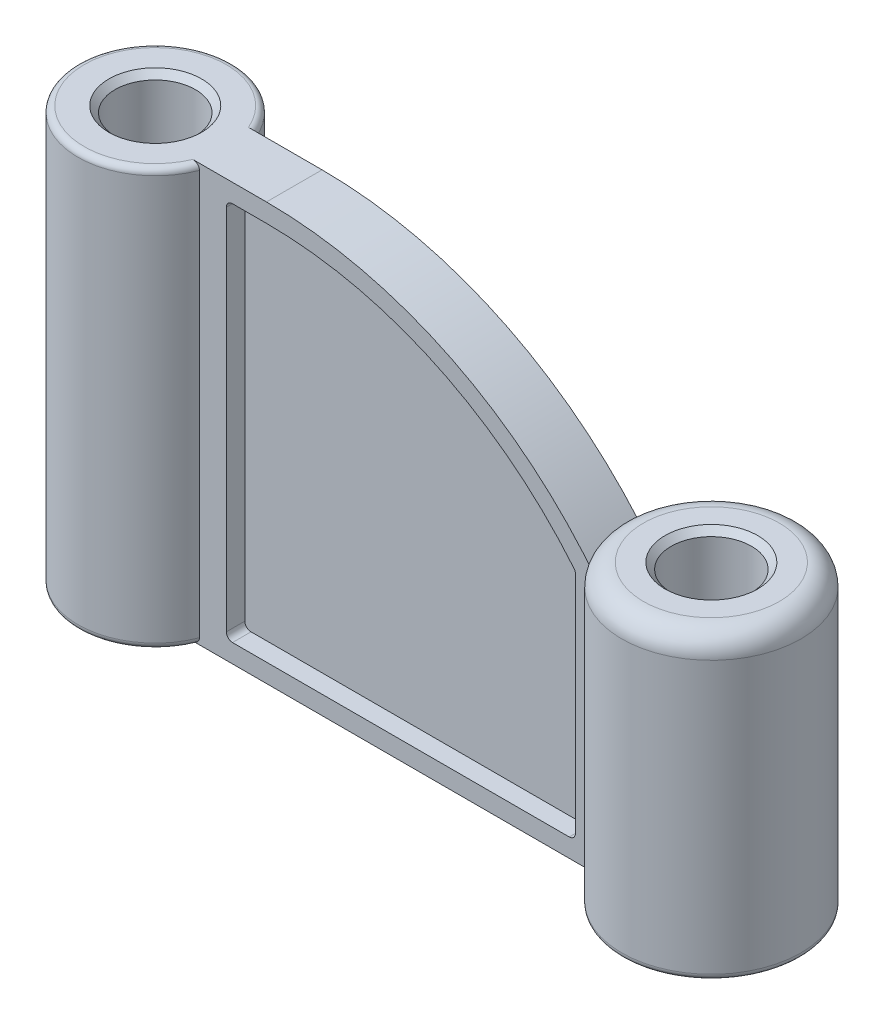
from build123d import *

# Parameters (mm, degrees)
SKETCH1_R               = 13
BOSS_EXTRUDE1_DEPTH     = 135
CUT_EXTRUDE2_DEPTH      = 252.694258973
CUT_EXTRUDE3_DEPTH      = 251.49351289
CUT_EXTRUDE3_DEPTH_BACK = 251.49351289
SKETCH3_W               = 56.568097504
SKETCH3_H               = 100
BOSS_EXTRUDE2_REACH     = 234.23
SKETCH4_R               = 29
SKETCH4_R_2             = 13
CUT_EXTRUDE4_DEPTH      = 6
CHAMFER1_SIZE           = 2
FILLET1_R               = 7
FILLET2_R               = 2


with BuildPart() as part:
    # Sketch1 → Boss-Extrude1 (new body)
    with BuildSketch(Plane(origin=(0, 0, 0), x_dir=(1, 0, 0), z_dir=(0, 1, 0))):
        with BuildLine():
            Line((23.323807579, -9), (152.431902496, -9))
            ThreePointArc((152.431902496, -9), (209, 0), (152.431902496, 9))
            Line((152.431902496, 9), (23.323807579, 9))
            ThreePointArc((23.323807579, 9), (-25, 0), (23.323807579, -9))
        make_face()
        with Locations(Location((0, 0, 0), (0, 0, 270))):
            Circle(SKETCH1_R, mode=Mode.SUBTRACT)
        with Locations(Location((180, 0, 0), (0, 0, 270))):
            Circle(SKETCH1_R, mode=Mode.SUBTRACT)
    extrude(amount=BOSS_EXTRUDE1_DEPTH)

    # Sketch2 → Cut-Extrude2 (cut, through all)
    with BuildSketch(Plane.XY.offset(9)):
        with BuildLine():
            Line((23.323807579, 135), (45, 135))
            ThreePointArc((45, 135), (104.951991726, 120.957673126), (152.431902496, 81.751980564))
            Line((152.431902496, 81.751980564), (152.431902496, 171.443845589))
            Line((152.431902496, 171.443845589), (23.323807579, 171.443845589))
            Line((23.323807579, 171.443845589), (23.323807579, 135))
        make_face()
    extrude(amount=-CUT_EXTRUDE2_DEPTH, mode=Mode.SUBTRACT)

    # Sketch3 → Cut-Extrude3 (cut, two sides: drawn at the far end of the back side and taken through both)
    with BuildSketch(Plane.XY.offset(-CUT_EXTRUDE3_DEPTH_BACK)):
        with Locations((180.715951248, 147)):
            Rectangle(SKETCH3_W, SKETCH3_H)
    extrude(amount=CUT_EXTRUDE3_DEPTH + CUT_EXTRUDE3_DEPTH_BACK, mode=Mode.SUBTRACT)

    # Sketch4 → Boss-Extrude2 (add, up to next)
    with BuildSketch(Plane(origin=(0, 97, 0), x_dir=(1, 0, 0), z_dir=(0, 1, 0)), mode=Mode.PRIVATE) as boss_extrude2_sk1:
        with Locations(Location((180, 0, 0), (0, 0, 161.919987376))):
            Circle(SKETCH4_R)
        with Locations((180, 0)):
            Circle(SKETCH4_R_2, mode=Mode.SUBTRACT)
    boss_extrude2_tool1 = extrude(boss_extrude2_sk1.sketch, amount=-BOSS_EXTRUDE2_REACH, mode=Mode.PRIVATE) - part.part
    add(boss_extrude2_tool1.solids().sort_by_distance((206.788354, 97, 8.745442))[0])

    # Sketch5 → Cut-Extrude4 (cut)
    with BuildSketch(Plane.XY.offset(9)):
        with BuildLine():
            Line((32, 129), (32, 6))
            Line((32, 6), (145, 6))
            Line((145, 6), (145, 81.492330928))
            ThreePointArc((145, 81.492330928), (100.355619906, 116.519334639), (45, 129))
            Line((45, 129), (32, 129))
        make_face()
    cut_extrude4 = extrude(amount=-CUT_EXTRUDE4_DEPTH, mode=Mode.SUBTRACT)

    # Mirror1: Cut-Extrude4 across plane
    add(cut_extrude4.mirror(Plane.XY), mode=Mode.SUBTRACT)

    # Chamfer1
    chamfer1_edges = [part.edges().sort_by_distance(p)[0] for p in [
        (0, 0, -13),
        (0, 135, -13),
        (180, 0, -13),
        (180, 97, -13),
    ]]
    chamfer(chamfer1_edges, length=CHAMFER1_SIZE)

    # Fillet1
    fillet1_edges = [part.edges().sort_by_distance(p)[0] for p in [
        (207.568097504, 97, 9),
    ]]
    fillet(fillet1_edges, radius=FILLET1_R)

    # Fillet2
    fillet2_edges = [part.edges().sort_by_distance(p)[0] for p in [
        (-25, 135, 0),
        (-25, 0, 0),
        (209, 0, 0),
        (145, 81.492330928, 6),
        (145, 6, 6),
        (32, 6, 6),
        (32, 129, 6),
        (145, 6, -6),
        (145, 81.492330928, -6),
        (32, 129, -6),
        (32, 6, -6),
    ]]
    fillet(fillet2_edges, radius=FILLET2_R)


solid = part.part
